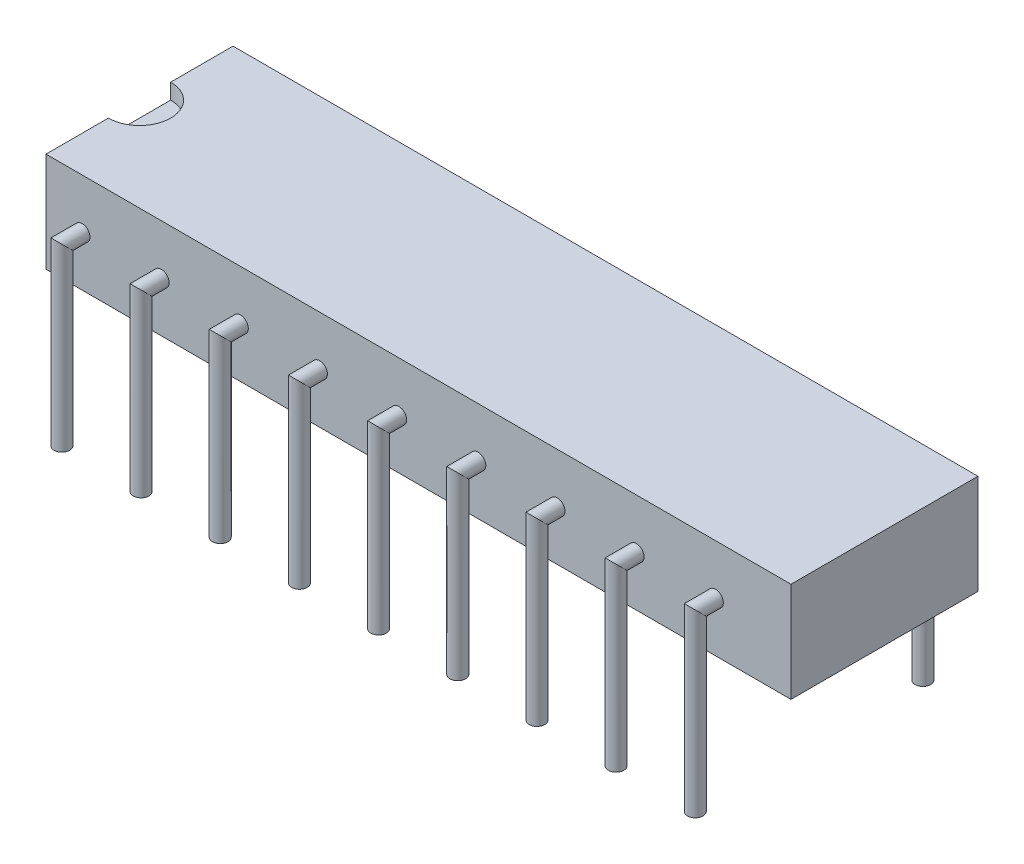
from build123d import *

# Parameters (mm, degrees)
ESQUISSE1_W                          = 6
ESQUISSE1_H                          = 3.2
EXTRUSION1_DEPTH                     = 23.9
ENL_V_MAT_EXTRU_1_DEPTH              = 0.5
ESQUISSE3_R                          = 0.25
R_P_TITION_LIN_AIRE1_COUNT           = 9
R_P_TITION_LIN_AIRE1_PITCH           = 2.54
R_P_TITION_LIN_AIRE1_COPY_1_SKETCH_R = 0.25
R_P_TITION_LIN_AIRE1_COPY_2_SKETCH_R = 0.25
R_P_TITION_LIN_AIRE1_COPY_3_SKETCH_R = 0.25
R_P_TITION_LIN_AIRE1_COPY_4_SKETCH_R = 0.25
R_P_TITION_LIN_AIRE1_COPY_5_SKETCH_R = 0.25
R_P_TITION_LIN_AIRE1_COPY_6_SKETCH_R = 0.25
R_P_TITION_LIN_AIRE1_COPY_7_SKETCH_R = 0.25
R_P_TITION_LIN_AIRE1_COPY_8_SKETCH_R = 0.25


with BuildPart() as part:
    # Esquisse1 → Extrusion1 (new body)
    with BuildSketch(Plane(origin=(0, 0, 0), x_dir=(0, 0, -1), z_dir=(1, 0, 0))):
        with Locations((0, 1.6)):
            Rectangle(ESQUISSE1_W, ESQUISSE1_H)
    extrude(amount=EXTRUSION1_DEPTH)

    # Esquisse2 → Enl_v. mat.-Extru.1 (cut)
    with BuildSketch(Plane(origin=(0, 3.2, 0), x_dir=(-1, 0, 0), z_dir=(0, 1, 0))):
        with BuildLine():
            Line((0, -1), (0, 1))
            ThreePointArc((0, 1), (-1, 0), (0, -1))
        make_face()
    extrude(amount=-ENL_V_MAT_EXTRU_1_DEPTH, mode=Mode.SUBTRACT)

    # Balayage1: sweep along a path in Esquisse5
    with BuildLine(Plane(origin=(1.16, 0, 0), x_dir=(0, 0, -1), z_dir=(1, 0, 0))) as balayage1_path:
        Line((-3, 1.6), (-3.65, 1.6))
        Line((-3.65, 1.6), (-3.65, -4))
    # Esquisse3 → Balayage1 (sweep)
    with BuildSketch(Plane.XY.offset(3)):
        with Locations((1.16, 1.6)):
            Circle(ESQUISSE3_R)
    balayage1 = sweep(path=balayage1_path.line, transition=Transition.RIGHT)

    # Sym_trie1: Balayage1 across plane
    add(balayage1.mirror(Plane.XY))

    # R_p_tition lin_aire1: Balayage1 ×9
    with Locations(*[(i * R_P_TITION_LIN_AIRE1_PITCH, 0, 0) for i in range(1, R_P_TITION_LIN_AIRE1_COUNT)]):
        add(balayage1)

    # R_p_tition lin_aire1 copy 1: sweep along a path in R_p_tition lin_aire1 copy 1 path
    with BuildLine(Plane(origin=(3.7, 0, 0), x_dir=(0, 0, 1), z_dir=(1, 0, 0))) as r_p_tition_lin_aire1_copy_1_path:
        Line((-3, -1.6), (-3.65, -1.6))
        Line((-3.65, -1.6), (-3.65, 4))
    # R_p_tition lin_aire1 copy 1 sketch → R_p_tition lin_aire1 copy 1 (sweep)
    with BuildSketch(Plane(origin=(2.54, 0, -3), x_dir=(1, 0, 0), z_dir=(0, 0, -1))):
        with Locations((1.16, -1.6)):
            Circle(R_P_TITION_LIN_AIRE1_COPY_1_SKETCH_R)
    sweep(path=r_p_tition_lin_aire1_copy_1_path.line, transition=Transition.RIGHT)

    # R_p_tition lin_aire1 copy 2: sweep along a path in R_p_tition lin_aire1 copy 2 path
    with BuildLine(Plane(origin=(6.24, 0, 0), x_dir=(0, 0, 1), z_dir=(1, 0, 0))) as r_p_tition_lin_aire1_copy_2_path:
        Line((-3, -1.6), (-3.65, -1.6))
        Line((-3.65, -1.6), (-3.65, 4))
    # R_p_tition lin_aire1 copy 2 sketch → R_p_tition lin_aire1 copy 2 (sweep)
    with BuildSketch(Plane(origin=(5.08, 0, -3), x_dir=(1, 0, 0), z_dir=(0, 0, -1))):
        with Locations((1.16, -1.6)):
            Circle(R_P_TITION_LIN_AIRE1_COPY_2_SKETCH_R)
    sweep(path=r_p_tition_lin_aire1_copy_2_path.line, transition=Transition.RIGHT)

    # R_p_tition lin_aire1 copy 3: sweep along a path in R_p_tition lin_aire1 copy 3 path
    with BuildLine(Plane(origin=(8.78, 0, 0), x_dir=(0, 0, 1), z_dir=(1, 0, 0))) as r_p_tition_lin_aire1_copy_3_path:
        Line((-3, -1.6), (-3.65, -1.6))
        Line((-3.65, -1.6), (-3.65, 4))
    # R_p_tition lin_aire1 copy 3 sketch → R_p_tition lin_aire1 copy 3 (sweep)
    with BuildSketch(Plane(origin=(7.62, 0, -3), x_dir=(1, 0, 0), z_dir=(0, 0, -1))):
        with Locations((1.16, -1.6)):
            Circle(R_P_TITION_LIN_AIRE1_COPY_3_SKETCH_R)
    sweep(path=r_p_tition_lin_aire1_copy_3_path.line, transition=Transition.RIGHT)

    # R_p_tition lin_aire1 copy 4: sweep along a path in R_p_tition lin_aire1 copy 4 path
    with BuildLine(Plane(origin=(11.32, 0, 0), x_dir=(0, 0, 1), z_dir=(1, 0, 0))) as r_p_tition_lin_aire1_copy_4_path:
        Line((-3, -1.6), (-3.65, -1.6))
        Line((-3.65, -1.6), (-3.65, 4))
    # R_p_tition lin_aire1 copy 4 sketch → R_p_tition lin_aire1 copy 4 (sweep)
    with BuildSketch(Plane(origin=(10.16, 0, -3), x_dir=(1, 0, 0), z_dir=(0, 0, -1))):
        with Locations((1.16, -1.6)):
            Circle(R_P_TITION_LIN_AIRE1_COPY_4_SKETCH_R)
    sweep(path=r_p_tition_lin_aire1_copy_4_path.line, transition=Transition.RIGHT)

    # R_p_tition lin_aire1 copy 5: sweep along a path in R_p_tition lin_aire1 copy 5 path
    with BuildLine(Plane(origin=(13.86, 0, 0), x_dir=(0, 0, 1), z_dir=(1, 0, 0))) as r_p_tition_lin_aire1_copy_5_path:
        Line((-3, -1.6), (-3.65, -1.6))
        Line((-3.65, -1.6), (-3.65, 4))
    # R_p_tition lin_aire1 copy 5 sketch → R_p_tition lin_aire1 copy 5 (sweep)
    with BuildSketch(Plane(origin=(12.7, 0, -3), x_dir=(1, 0, 0), z_dir=(0, 0, -1))):
        with Locations((1.16, -1.6)):
            Circle(R_P_TITION_LIN_AIRE1_COPY_5_SKETCH_R)
    sweep(path=r_p_tition_lin_aire1_copy_5_path.line, transition=Transition.RIGHT)

    # R_p_tition lin_aire1 copy 6: sweep along a path in R_p_tition lin_aire1 copy 6 path
    with BuildLine(Plane(origin=(16.4, 0, 0), x_dir=(0, 0, 1), z_dir=(1, 0, 0))) as r_p_tition_lin_aire1_copy_6_path:
        Line((-3, -1.6), (-3.65, -1.6))
        Line((-3.65, -1.6), (-3.65, 4))
    # R_p_tition lin_aire1 copy 6 sketch → R_p_tition lin_aire1 copy 6 (sweep)
    with BuildSketch(Plane(origin=(15.24, 0, -3), x_dir=(1, 0, 0), z_dir=(0, 0, -1))):
        with Locations((1.16, -1.6)):
            Circle(R_P_TITION_LIN_AIRE1_COPY_6_SKETCH_R)
    sweep(path=r_p_tition_lin_aire1_copy_6_path.line, transition=Transition.RIGHT)

    # R_p_tition lin_aire1 copy 7: sweep along a path in R_p_tition lin_aire1 copy 7 path
    with BuildLine(Plane(origin=(18.94, 0, 0), x_dir=(0, 0, 1), z_dir=(1, 0, 0))) as r_p_tition_lin_aire1_copy_7_path:
        Line((-3, -1.6), (-3.65, -1.6))
        Line((-3.65, -1.6), (-3.65, 4))
    # R_p_tition lin_aire1 copy 7 sketch → R_p_tition lin_aire1 copy 7 (sweep)
    with BuildSketch(Plane(origin=(17.78, 0, -3), x_dir=(1, 0, 0), z_dir=(0, 0, -1))):
        with Locations((1.16, -1.6)):
            Circle(R_P_TITION_LIN_AIRE1_COPY_7_SKETCH_R)
    sweep(path=r_p_tition_lin_aire1_copy_7_path.line, transition=Transition.RIGHT)

    # R_p_tition lin_aire1 copy 8: sweep along a path in R_p_tition lin_aire1 copy 8 path
    with BuildLine(Plane(origin=(21.48, 0, 0), x_dir=(0, 0, 1), z_dir=(1, 0, 0))) as r_p_tition_lin_aire1_copy_8_path:
        Line((-3, -1.6), (-3.65, -1.6))
        Line((-3.65, -1.6), (-3.65, 4))
    # R_p_tition lin_aire1 copy 8 sketch → R_p_tition lin_aire1 copy 8 (sweep)
    with BuildSketch(Plane(origin=(20.32, 0, -3), x_dir=(1, 0, 0), z_dir=(0, 0, -1))):
        with Locations((1.16, -1.6)):
            Circle(R_P_TITION_LIN_AIRE1_COPY_8_SKETCH_R)
    sweep(path=r_p_tition_lin_aire1_copy_8_path.line, transition=Transition.RIGHT)


solid = part.part
